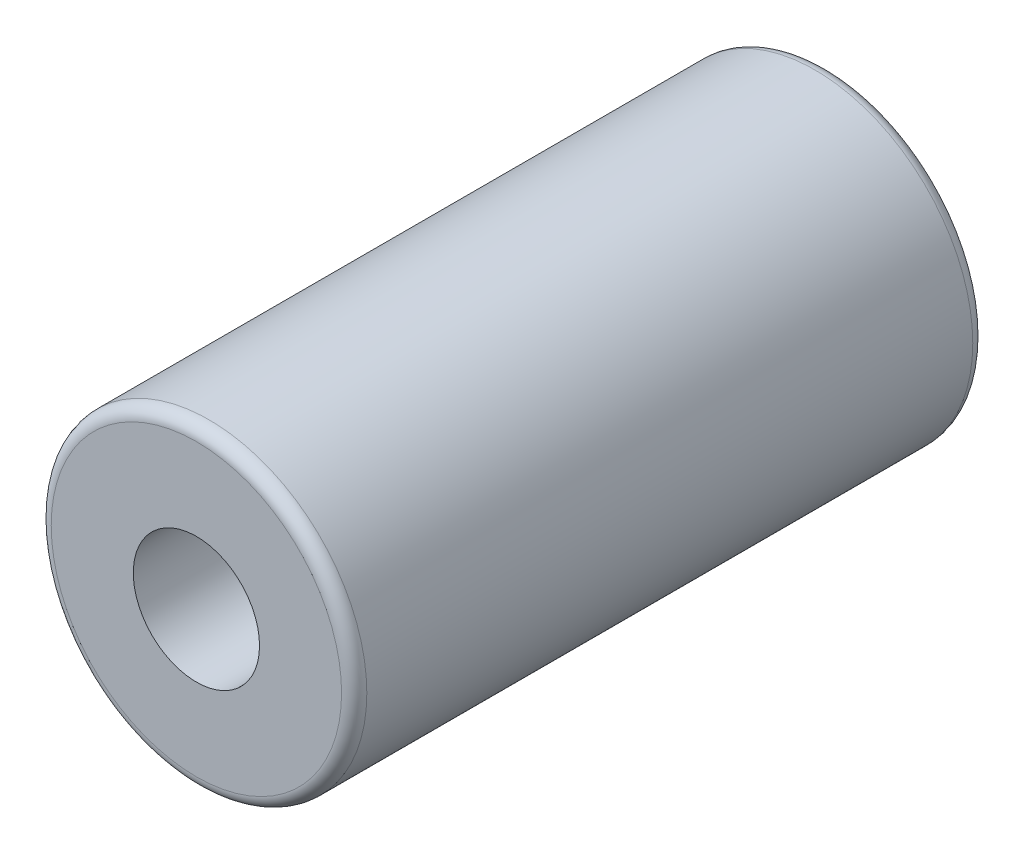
ISO-10303-21;
HEADER;
FILE_DESCRIPTION(('STEP AP214'),'2;1');
FILE_NAME('part.step','',(''),(''),'','','');
FILE_SCHEMA(('AUTOMOTIVE_DESIGN { 1 0 10303 214 1 1 1 1 }'));
ENDSEC;
DATA;
#1=APPLICATION_CONTEXT('core data for automotive mechanical design processes');
#2=APPLICATION_PROTOCOL_DEFINITION('international standard','automotive_design',2000,#1);
#3=PRODUCT_CONTEXT('',#1,'mechanical');
#4=PRODUCT('Part','Part','',(#3));
#5=PRODUCT_RELATED_PRODUCT_CATEGORY('part','',(#4));
#6=PRODUCT_DEFINITION_FORMATION('','',#4);
#7=PRODUCT_DEFINITION_CONTEXT('part definition',#1,'design');
#8=PRODUCT_DEFINITION('design','',#6,#7);
#9=PRODUCT_DEFINITION_SHAPE('','',#8);
#10=(LENGTH_UNIT() NAMED_UNIT(*) SI_UNIT(.MILLI.,.METRE.));
#11=(NAMED_UNIT(*) PLANE_ANGLE_UNIT() SI_UNIT($,.RADIAN.));
#12=(NAMED_UNIT(*) SI_UNIT($,.STERADIAN.) SOLID_ANGLE_UNIT());
#13=UNCERTAINTY_MEASURE_WITH_UNIT(LENGTH_MEASURE(1.E-05),#10,'distance_accuracy_value','');
#14=(GEOMETRIC_REPRESENTATION_CONTEXT(3) GLOBAL_UNCERTAINTY_ASSIGNED_CONTEXT((#13)) GLOBAL_UNIT_ASSIGNED_CONTEXT((#10,
#11,#12)) REPRESENTATION_CONTEXT('',''));
#15=CARTESIAN_POINT('',(0.,0.,0.));
#16=DIRECTION('',(0.,0.,1.));
#17=DIRECTION('',(1.,0.,0.));
#18=AXIS2_PLACEMENT_3D('',#15,#16,#17);
#19=CARTESIAN_POINT('',(0.,0.,127.));
#20=DIRECTION('',(0.,0.,1.));
#21=DIRECTION('',(1.,0.,0.));
#22=AXIS2_PLACEMENT_3D('',#19,#20,#21);
#23=PLANE('',#22);
#24=CARTESIAN_POINT('',(0.,0.,127.));
#25=DIRECTION('',(0.,0.,1.));
#26=DIRECTION('',(1.,0.,0.));
#27=AXIS2_PLACEMENT_3D('',#24,#25,#26);
#28=CIRCLE('',#27,29.21);
#29=CARTESIAN_POINT('',(29.21,0.,127.));
#30=VERTEX_POINT('',#29);
#31=EDGE_CURVE('E58',#30,#30,#28,.T.);
#32=ORIENTED_EDGE('',*,*,#31,.T.);
#33=EDGE_LOOP('',(#32));
#34=FACE_BOUND('',#33,.T.);
#35=CARTESIAN_POINT('',(0.,0.,127.));
#36=DIRECTION('',(0.,0.,1.));
#37=DIRECTION('',(1.,0.,0.));
#38=AXIS2_PLACEMENT_3D('',#35,#36,#37);
#39=CIRCLE('',#38,12.7);
#40=CARTESIAN_POINT('',(12.7,0.,127.));
#41=VERTEX_POINT('',#40);
#42=EDGE_CURVE('E64',#41,#41,#39,.T.);
#43=ORIENTED_EDGE('',*,*,#42,.F.);
#44=EDGE_LOOP('',(#43));
#45=FACE_BOUND('',#44,.T.);
#46=ADVANCED_FACE('F40',(#34,#45),#23,.T.);
#47=CARTESIAN_POINT('',(0.,0.,0.));
#48=DIRECTION('',(0.,0.,1.));
#49=DIRECTION('',(1.,0.,0.));
#50=AXIS2_PLACEMENT_3D('',#47,#48,#49);
#51=PLANE('',#50);
#52=CARTESIAN_POINT('',(0.,0.,0.));
#53=DIRECTION('',(0.,0.,1.));
#54=DIRECTION('',(1.,0.,0.));
#55=AXIS2_PLACEMENT_3D('',#52,#53,#54);
#56=CIRCLE('',#55,29.21);
#57=CARTESIAN_POINT('',(29.21,0.,0.));
#58=VERTEX_POINT('',#57);
#59=EDGE_CURVE('E10',#58,#58,#56,.F.);
#60=ORIENTED_EDGE('',*,*,#59,.T.);
#61=EDGE_LOOP('',(#60));
#62=FACE_BOUND('',#61,.T.);
#63=CARTESIAN_POINT('',(0.,0.,0.));
#64=DIRECTION('',(0.,0.,1.));
#65=DIRECTION('',(1.,0.,0.));
#66=AXIS2_PLACEMENT_3D('',#63,#64,#65);
#67=CIRCLE('',#66,12.7);
#68=CARTESIAN_POINT('',(12.7,0.,0.));
#69=VERTEX_POINT('',#68);
#70=EDGE_CURVE('E65',#69,#69,#67,.T.);
#71=ORIENTED_EDGE('',*,*,#70,.T.);
#72=EDGE_LOOP('',(#71));
#73=FACE_BOUND('',#72,.T.);
#74=ADVANCED_FACE('F77',(#62,#73),#51,.F.);
#75=CARTESIAN_POINT('',(0.,0.,127.));
#76=DIRECTION('',(0.,0.,-1.));
#77=DIRECTION('',(-1.,0.,0.));
#78=AXIS2_PLACEMENT_3D('',#75,#76,#77);
#79=CYLINDRICAL_SURFACE('',#78,31.75);
#80=CARTESIAN_POINT('',(0.,0.,124.46));
#81=DIRECTION('',(0.,0.,1.));
#82=DIRECTION('',(1.,0.,0.));
#83=AXIS2_PLACEMENT_3D('',#80,#81,#82);
#84=CIRCLE('',#83,31.75);
#85=CARTESIAN_POINT('',(31.75,0.,124.46));
#86=VERTEX_POINT('',#85);
#87=EDGE_CURVE('E48',#86,#86,#84,.F.);
#88=ORIENTED_EDGE('',*,*,#87,.T.);
#89=EDGE_LOOP('',(#88));
#90=FACE_BOUND('',#89,.T.);
#91=CARTESIAN_POINT('',(0.,0.,2.54));
#92=DIRECTION('',(0.,0.,1.));
#93=DIRECTION('',(1.,0.,0.));
#94=AXIS2_PLACEMENT_3D('',#91,#92,#93);
#95=CIRCLE('',#94,31.75);
#96=CARTESIAN_POINT('',(31.75,0.,2.54));
#97=VERTEX_POINT('',#96);
#98=EDGE_CURVE('E53',#97,#97,#95,.T.);
#99=ORIENTED_EDGE('',*,*,#98,.T.);
#100=EDGE_LOOP('',(#99));
#101=FACE_BOUND('',#100,.T.);
#102=ADVANCED_FACE('F84',(#90,#101),#79,.T.);
#103=CARTESIAN_POINT('',(0.,0.,127.));
#104=DIRECTION('',(0.,0.,-1.));
#105=DIRECTION('',(-1.,0.,0.));
#106=AXIS2_PLACEMENT_3D('',#103,#104,#105);
#107=CYLINDRICAL_SURFACE('',#106,12.7);
#108=ORIENTED_EDGE('',*,*,#42,.T.);
#109=EDGE_LOOP('',(#108));
#110=FACE_BOUND('',#109,.T.);
#111=ORIENTED_EDGE('',*,*,#70,.F.);
#112=EDGE_LOOP('',(#111));
#113=FACE_BOUND('',#112,.T.);
#114=ADVANCED_FACE('F73',(#110,#113),#107,.F.);
#115=CARTESIAN_POINT('',(0.,0.,124.46));
#116=DIRECTION('',(0.,0.,1.));
#117=DIRECTION('',(1.,0.,0.));
#118=AXIS2_PLACEMENT_3D('',#115,#116,#117);
#119=TOROIDAL_SURFACE('',#118,29.21,2.54);
#120=ORIENTED_EDGE('',*,*,#87,.F.);
#121=EDGE_LOOP('',(#120));
#122=FACE_BOUND('',#121,.T.);
#123=ORIENTED_EDGE('',*,*,#31,.F.);
#124=EDGE_LOOP('',(#123));
#125=FACE_BOUND('',#124,.T.);
#126=ADVANCED_FACE('F89',(#122,#125),#119,.T.);
#127=CARTESIAN_POINT('',(0.,0.,2.54));
#128=DIRECTION('',(0.,0.,1.));
#129=DIRECTION('',(1.,0.,0.));
#130=AXIS2_PLACEMENT_3D('',#127,#128,#129);
#131=TOROIDAL_SURFACE('',#130,29.21,2.54);
#132=ORIENTED_EDGE('',*,*,#59,.F.);
#133=EDGE_LOOP('',(#132));
#134=FACE_BOUND('',#133,.T.);
#135=ORIENTED_EDGE('',*,*,#98,.F.);
#136=EDGE_LOOP('',(#135));
#137=FACE_BOUND('',#136,.T.);
#138=ADVANCED_FACE('F42',(#134,#137),#131,.T.);
#139=CLOSED_SHELL('',(#46,#74,#102,#114,#126,#138));
#140=MANIFOLD_SOLID_BREP('B2',#139);
#141=ADVANCED_BREP_SHAPE_REPRESENTATION('',(#18,#140),#14);
#142=SHAPE_DEFINITION_REPRESENTATION(#9,#141);
ENDSEC;
END-ISO-10303-21;
